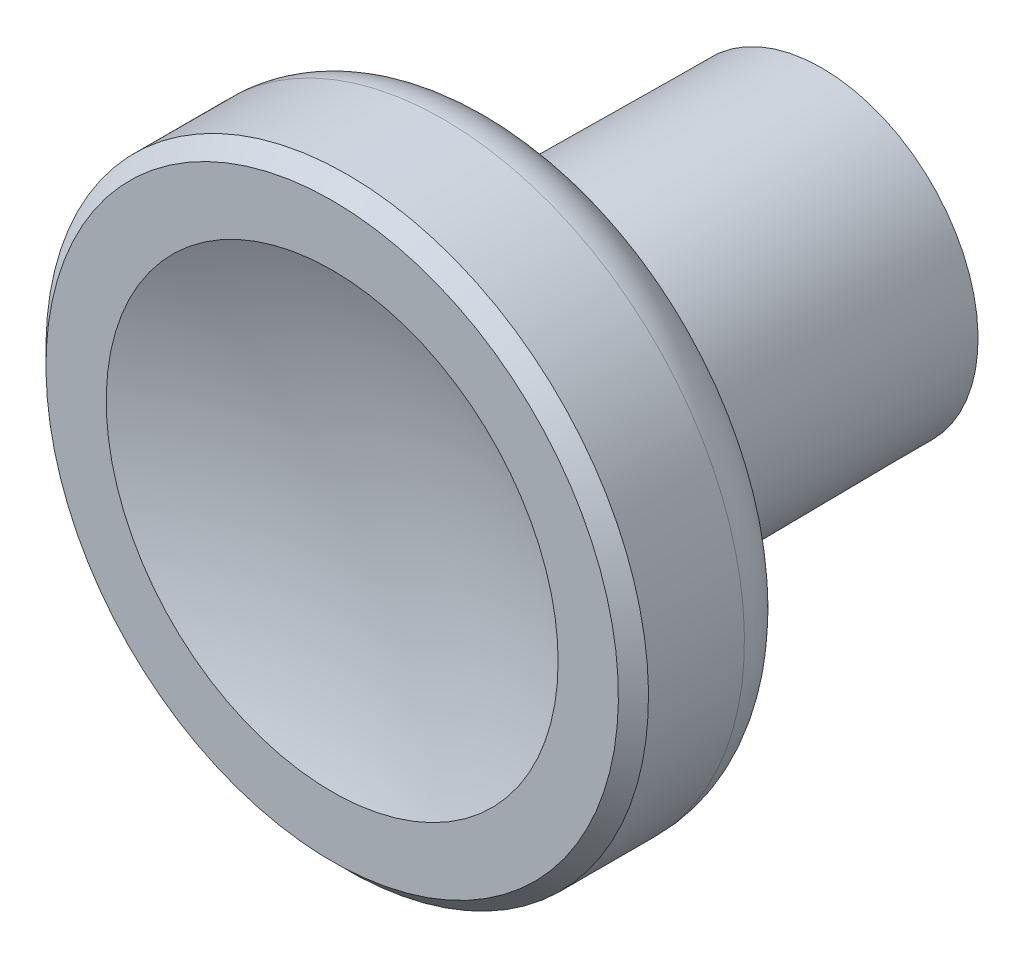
ISO-10303-21;
HEADER;
FILE_DESCRIPTION(('STEP AP214'),'2;1');
FILE_NAME('part.step','',(''),(''),'','','');
FILE_SCHEMA(('AUTOMOTIVE_DESIGN { 1 0 10303 214 1 1 1 1 }'));
ENDSEC;
DATA;
#1=APPLICATION_CONTEXT('core data for automotive mechanical design processes');
#2=APPLICATION_PROTOCOL_DEFINITION('international standard','automotive_design',2000,#1);
#3=PRODUCT_CONTEXT('',#1,'mechanical');
#4=PRODUCT('Part','Part','',(#3));
#5=PRODUCT_RELATED_PRODUCT_CATEGORY('part','',(#4));
#6=PRODUCT_DEFINITION_FORMATION('','',#4);
#7=PRODUCT_DEFINITION_CONTEXT('part definition',#1,'design');
#8=PRODUCT_DEFINITION('design','',#6,#7);
#9=PRODUCT_DEFINITION_SHAPE('','',#8);
#10=(LENGTH_UNIT() NAMED_UNIT(*) SI_UNIT(.MILLI.,.METRE.));
#11=(NAMED_UNIT(*) PLANE_ANGLE_UNIT() SI_UNIT($,.RADIAN.));
#12=(NAMED_UNIT(*) SI_UNIT($,.STERADIAN.) SOLID_ANGLE_UNIT());
#13=UNCERTAINTY_MEASURE_WITH_UNIT(LENGTH_MEASURE(1.E-05),#10,'distance_accuracy_value','');
#14=(GEOMETRIC_REPRESENTATION_CONTEXT(3) GLOBAL_UNCERTAINTY_ASSIGNED_CONTEXT((#13)) GLOBAL_UNIT_ASSIGNED_CONTEXT((#10,
#11,#12)) REPRESENTATION_CONTEXT('',''));
#15=CARTESIAN_POINT('',(0.,0.,0.));
#16=DIRECTION('',(0.,0.,1.));
#17=DIRECTION('',(1.,0.,0.));
#18=AXIS2_PLACEMENT_3D('',#15,#16,#17);
#19=CARTESIAN_POINT('',(0.,0.,0.));
#20=DIRECTION('',(0.,0.,-1.));
#21=DIRECTION('',(0.,1.,0.));
#22=AXIS2_PLACEMENT_3D('',#19,#20,#21);
#23=PLANE('',#22);
#24=CARTESIAN_POINT('',(0.,0.,0.));
#25=DIRECTION('',(0.,0.,-1.));
#26=DIRECTION('',(0.,1.,0.));
#27=AXIS2_PLACEMENT_3D('',#24,#25,#26);
#28=CIRCLE('',#27,1.5);
#29=CARTESIAN_POINT('',(0.,1.5,0.));
#30=VERTEX_POINT('',#29);
#31=EDGE_CURVE('E46',#30,#30,#28,.T.);
#32=ORIENTED_EDGE('',*,*,#31,.F.);
#33=EDGE_LOOP('',(#32));
#34=FACE_BOUND('',#33,.T.);
#35=CARTESIAN_POINT('',(0.,0.,0.));
#36=DIRECTION('',(0.,0.,-1.));
#37=DIRECTION('',(0.,1.,0.));
#38=AXIS2_PLACEMENT_3D('',#35,#36,#37);
#39=CIRCLE('',#38,4.15);
#40=CARTESIAN_POINT('',(0.,4.15,0.));
#41=VERTEX_POINT('',#40);
#42=EDGE_CURVE('E8',#41,#41,#39,.T.);
#43=ORIENTED_EDGE('',*,*,#42,.T.);
#44=EDGE_LOOP('',(#43));
#45=FACE_BOUND('',#44,.T.);
#46=ADVANCED_FACE('F12',(#34,#45),#23,.T.);
#47=CARTESIAN_POINT('',(0.,0.,0.));
#48=DIRECTION('',(0.,0.,1.));
#49=DIRECTION('',(0.,-1.,0.));
#50=AXIS2_PLACEMENT_3D('',#47,#48,#49);
#51=CONICAL_SURFACE('',#50,4.15,0.0087266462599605);
#52=CARTESIAN_POINT('',(0.,0.,7.31847461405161));
#53=DIRECTION('',(0.,0.,-1.));
#54=DIRECTION('',(0.,1.,0.));
#55=AXIS2_PLACEMENT_3D('',#52,#53,#54);
#56=CIRCLE('',#55,4.21386736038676);
#57=CARTESIAN_POINT('',(0.,4.21386736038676,7.31847461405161));
#58=VERTEX_POINT('',#57);
#59=EDGE_CURVE('E18',#58,#58,#56,.T.);
#60=ORIENTED_EDGE('',*,*,#59,.T.);
#61=EDGE_LOOP('',(#60));
#62=FACE_BOUND('',#61,.T.);
#63=ORIENTED_EDGE('',*,*,#42,.F.);
#64=EDGE_LOOP('',(#63));
#65=FACE_BOUND('',#64,.T.);
#66=ADVANCED_FACE('F53',(#62,#65),#51,.T.);
#67=CARTESIAN_POINT('',(0.,0.,7.31192971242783));
#68=DIRECTION('',(0.,0.,-1.));
#69=DIRECTION('',(0.,1.,0.));
#70=AXIS2_PLACEMENT_3D('',#67,#68,#69);
#71=TOROIDAL_SURFACE('',#70,4.96383880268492,0.750000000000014);
#72=CARTESIAN_POINT('',(0.,0.,8.03637408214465));
#73=DIRECTION('',(0.,0.,-1.));
#74=DIRECTION('',(0.,1.,0.));
#75=AXIS2_PLACEMENT_3D('',#72,#73,#74);
#76=CIRCLE('',#75,4.76972451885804);
#77=CARTESIAN_POINT('',(0.,4.76972451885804,8.03637408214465));
#78=VERTEX_POINT('',#77);
#79=EDGE_CURVE('E22',#78,#78,#76,.T.);
#80=ORIENTED_EDGE('',*,*,#79,.T.);
#81=EDGE_LOOP('',(#80));
#82=FACE_BOUND('',#81,.T.);
#83=ORIENTED_EDGE('',*,*,#59,.F.);
#84=EDGE_LOOP('',(#83));
#85=FACE_BOUND('',#84,.T.);
#86=ADVANCED_FACE('F59',(#82,#85),#71,.F.);
#87=CARTESIAN_POINT('',(0.,0.,8.03637408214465));
#88=DIRECTION('',(0.,0.,1.));
#89=DIRECTION('',(0.,-1.,0.));
#90=AXIS2_PLACEMENT_3D('',#87,#88,#89);
#91=CONICAL_SURFACE('',#90,4.76972451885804,1.30899693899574);
#92=CARTESIAN_POINT('',(0.,0.,8.60402553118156));
#93=DIRECTION('',(0.,0.,-1.));
#94=DIRECTION('',(0.,1.,0.));
#95=AXIS2_PLACEMENT_3D('',#92,#93,#94);
#96=CIRCLE('',#95,6.88822856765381);
#97=CARTESIAN_POINT('',(0.,6.88822856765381,8.60402553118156));
#98=VERTEX_POINT('',#97);
#99=EDGE_CURVE('E26',#98,#98,#96,.T.);
#100=ORIENTED_EDGE('',*,*,#99,.T.);
#101=EDGE_LOOP('',(#100));
#102=FACE_BOUND('',#101,.T.);
#103=ORIENTED_EDGE('',*,*,#79,.F.);
#104=EDGE_LOOP('',(#103));
#105=FACE_BOUND('',#104,.T.);
#106=ADVANCED_FACE('F64',(#102,#105),#91,.T.);
#107=CARTESIAN_POINT('',(0.,0.,10.0529142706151));
#108=DIRECTION('',(0.,0.,-1.));
#109=DIRECTION('',(0.,1.,0.));
#110=AXIS2_PLACEMENT_3D('',#107,#108,#109);
#111=TOROIDAL_SURFACE('',#110,6.5,1.49999999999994);
#112=CARTESIAN_POINT('',(0.,0.,10.0529142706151));
#113=DIRECTION('',(0.,0.,-1.));
#114=DIRECTION('',(0.,1.,0.));
#115=AXIS2_PLACEMENT_3D('',#112,#113,#114);
#116=CIRCLE('',#115,8.);
#117=CARTESIAN_POINT('',(0.,8.,10.0529142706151));
#118=VERTEX_POINT('',#117);
#119=EDGE_CURVE('E31',#118,#118,#116,.T.);
#120=ORIENTED_EDGE('',*,*,#119,.T.);
#121=EDGE_LOOP('',(#120));
#122=FACE_BOUND('',#121,.T.);
#123=ORIENTED_EDGE('',*,*,#99,.F.);
#124=EDGE_LOOP('',(#123));
#125=FACE_BOUND('',#124,.T.);
#126=ADVANCED_FACE('F71',(#122,#125),#111,.T.);
#127=CARTESIAN_POINT('',(0.,0.,0.));
#128=DIRECTION('',(0.,0.,-1.));
#129=DIRECTION('',(0.,1.,0.));
#130=AXIS2_PLACEMENT_3D('',#127,#128,#129);
#131=CYLINDRICAL_SURFACE('',#130,8.);
#132=CARTESIAN_POINT('',(0.,0.,12.6));
#133=DIRECTION('',(0.,0.,-1.));
#134=DIRECTION('',(0.,1.,0.));
#135=AXIS2_PLACEMENT_3D('',#132,#133,#134);
#136=CIRCLE('',#135,8.);
#137=CARTESIAN_POINT('',(0.,8.,12.6));
#138=VERTEX_POINT('',#137);
#139=EDGE_CURVE('E34',#138,#138,#136,.T.);
#140=ORIENTED_EDGE('',*,*,#139,.T.);
#141=EDGE_LOOP('',(#140));
#142=FACE_BOUND('',#141,.T.);
#143=ORIENTED_EDGE('',*,*,#119,.F.);
#144=EDGE_LOOP('',(#143));
#145=FACE_BOUND('',#144,.T.);
#146=ADVANCED_FACE('F75',(#142,#145),#131,.T.);
#147=CARTESIAN_POINT('',(0.,0.,12.6));
#148=DIRECTION('',(0.,0.,-1.));
#149=DIRECTION('',(0.,1.,0.));
#150=AXIS2_PLACEMENT_3D('',#147,#148,#149);
#151=CONICAL_SURFACE('',#150,8.,0.785398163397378);
#152=CARTESIAN_POINT('',(0.,0.,13.));
#153=DIRECTION('',(0.,0.,-1.));
#154=DIRECTION('',(0.,1.,0.));
#155=AXIS2_PLACEMENT_3D('',#152,#153,#154);
#156=CIRCLE('',#155,7.6);
#157=CARTESIAN_POINT('',(0.,7.6,13.));
#158=VERTEX_POINT('',#157);
#159=EDGE_CURVE('E37',#158,#158,#156,.T.);
#160=ORIENTED_EDGE('',*,*,#159,.T.);
#161=EDGE_LOOP('',(#160));
#162=FACE_BOUND('',#161,.T.);
#163=ORIENTED_EDGE('',*,*,#139,.F.);
#164=EDGE_LOOP('',(#163));
#165=FACE_BOUND('',#164,.T.);
#166=ADVANCED_FACE('F79',(#162,#165),#151,.T.);
#167=CARTESIAN_POINT('',(6.,0.,13.));
#168=DIRECTION('',(0.,0.,1.));
#169=DIRECTION('',(0.,-1.,0.));
#170=AXIS2_PLACEMENT_3D('',#167,#168,#169);
#171=PLANE('',#170);
#172=CARTESIAN_POINT('',(0.,0.,13.));
#173=DIRECTION('',(0.,0.,-1.));
#174=DIRECTION('',(0.,1.,0.));
#175=AXIS2_PLACEMENT_3D('',#172,#173,#174);
#176=CIRCLE('',#175,6.);
#177=CARTESIAN_POINT('',(0.,6.,13.));
#178=VERTEX_POINT('',#177);
#179=EDGE_CURVE('E40',#178,#178,#176,.T.);
#180=ORIENTED_EDGE('',*,*,#179,.T.);
#181=EDGE_LOOP('',(#180));
#182=FACE_BOUND('',#181,.T.);
#183=ORIENTED_EDGE('',*,*,#159,.F.);
#184=EDGE_LOOP('',(#183));
#185=FACE_BOUND('',#184,.T.);
#186=ADVANCED_FACE('F83',(#182,#185),#171,.T.);
#187=CARTESIAN_POINT('',(0.,0.,27.7996153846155));
#188=DIRECTION('',(0.,0.,-1.));
#189=DIRECTION('',(1.,0.,0.));
#190=AXIS2_PLACEMENT_3D('',#187,#188,#189);
#191=SPHERICAL_SURFACE('',#190,15.9696153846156);
#192=ORIENTED_EDGE('',*,*,#179,.F.);
#193=EDGE_LOOP('',(#192));
#194=FACE_BOUND('',#193,.T.);
#195=ADVANCED_FACE('F87',(#194),#191,.F.);
#196=CARTESIAN_POINT('',(0.,0.,6.));
#197=DIRECTION('',(0.,0.,-1.));
#198=DIRECTION('',(0.,1.,0.));
#199=AXIS2_PLACEMENT_3D('',#196,#197,#198);
#200=CYLINDRICAL_SURFACE('',#199,1.5);
#201=CARTESIAN_POINT('',(0.,0.,6.));
#202=DIRECTION('',(0.,0.,-1.));
#203=DIRECTION('',(0.,1.,0.));
#204=AXIS2_PLACEMENT_3D('',#201,#202,#203);
#205=CIRCLE('',#204,1.5);
#206=CARTESIAN_POINT('',(0.,1.5,6.));
#207=VERTEX_POINT('',#206);
#208=EDGE_CURVE('E43',#207,#207,#205,.T.);
#209=ORIENTED_EDGE('',*,*,#208,.F.);
#210=EDGE_LOOP('',(#209));
#211=FACE_BOUND('',#210,.T.);
#212=ORIENTED_EDGE('',*,*,#31,.T.);
#213=EDGE_LOOP('',(#212));
#214=FACE_BOUND('',#213,.T.);
#215=ADVANCED_FACE('F50',(#211,#214),#200,.F.);
#216=CARTESIAN_POINT('',(0.,0.,6.));
#217=DIRECTION('',(0.,0.,-1.));
#218=DIRECTION('',(0.,1.,0.));
#219=AXIS2_PLACEMENT_3D('',#216,#217,#218);
#220=PLANE('',#219);
#221=ORIENTED_EDGE('',*,*,#208,.T.);
#222=EDGE_LOOP('',(#221));
#223=FACE_BOUND('',#222,.T.);
#224=ADVANCED_FACE('F94',(#223),#220,.T.);
#225=CLOSED_SHELL('',(#46,#66,#86,#106,#126,#146,#166,#186,#195,#215,#224));
#226=MANIFOLD_SOLID_BREP('B1',#225);
#227=ADVANCED_BREP_SHAPE_REPRESENTATION('',(#18,#226),#14);
#228=SHAPE_DEFINITION_REPRESENTATION(#9,#227);
ENDSEC;
END-ISO-10303-21;
